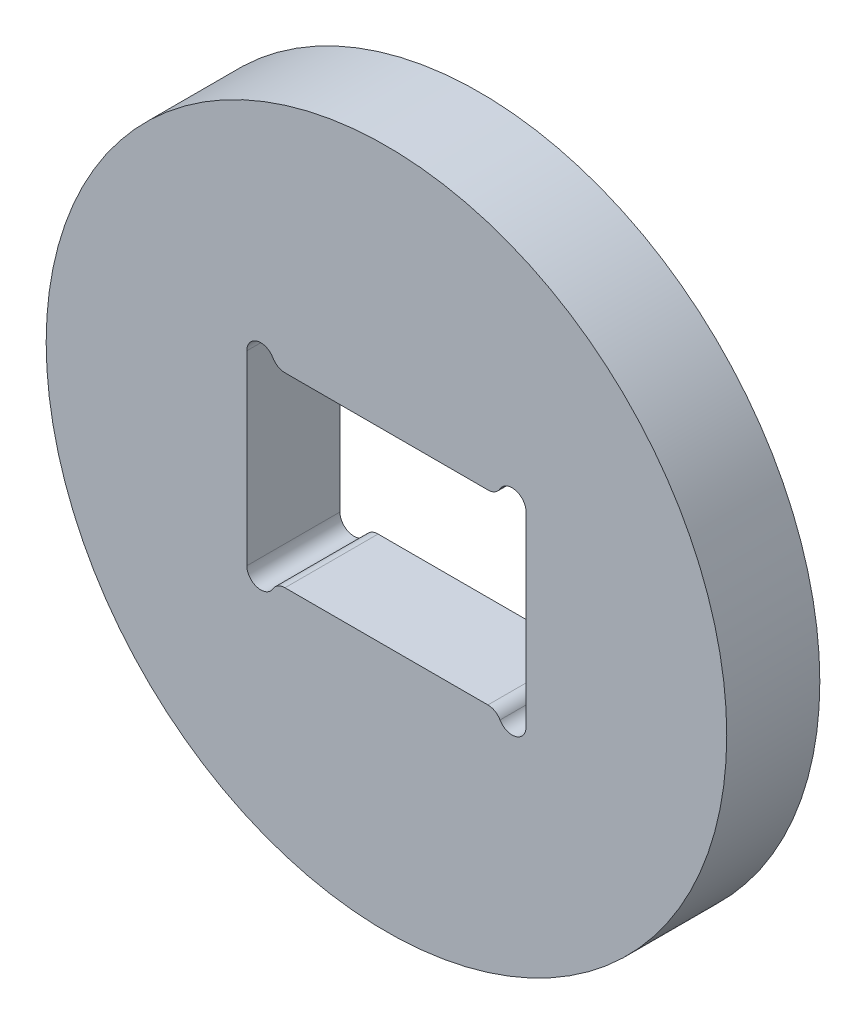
from build123d import *

# Parameters (mm, degrees)
ESQUISSE1_R        = 36.56
BOSS_EXTRU_1_DEPTH = 10


with BuildPart() as part:
    # Esquisse1 → Boss.-Extru.1 (new body)
    with BuildSketch(Plane.XY):
        with Locations((-62.046476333, 20.020145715)):
            Circle(ESQUISSE1_R)
        with BuildLine():
            Line((-47.046476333, 30.020145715), (-47.046476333, 10.020145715))
            ThreePointArc((-47.046476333, 10.020145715), (-48.158247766, 8.571256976), (-49.845514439, 9.270145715))
            ThreePointArc((-49.845514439, 9.270145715), (-50.394552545, 9.819183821), (-51.144552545, 10.020145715))
            Line((-51.144552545, 10.020145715), (-72.948400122, 10.020145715))
            ThreePointArc((-72.948400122, 10.020145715), (-73.698400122, 9.819183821), (-74.247438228, 9.270145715))
            ThreePointArc((-74.247438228, 9.270145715), (-75.934704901, 8.571256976), (-77.046476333, 10.020145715))
            Line((-77.046476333, 10.020145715), (-77.046476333, 30.020145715))
            ThreePointArc((-77.046476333, 30.020145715), (-75.934704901, 31.469034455), (-74.247438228, 30.770145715))
            ThreePointArc((-74.247438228, 30.770145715), (-73.698400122, 30.22110761), (-72.948400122, 30.020145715))
            Line((-72.948400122, 30.020145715), (-51.144552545, 30.020145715))
            ThreePointArc((-51.144552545, 30.020145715), (-50.394552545, 30.22110761), (-49.845514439, 30.770145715))
            ThreePointArc((-49.845514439, 30.770145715), (-48.158247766, 31.469034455), (-47.046476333, 30.020145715))
        make_face(mode=Mode.SUBTRACT)
    extrude(amount=BOSS_EXTRU_1_DEPTH)


solid = part.part
